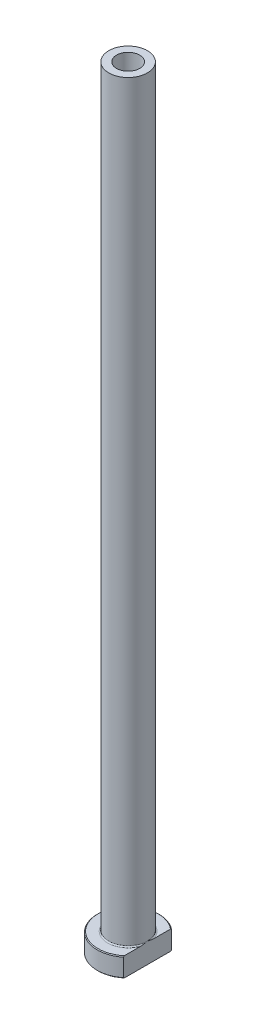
from build123d import *

# Parameters (mm, degrees)
FILLET1_R          = 0.3
CHAMFER1_SIZE      = 0.2
CUT_EXTRUDE1_DEPTH = 201.319744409
CHAMFER2_SIZE      = 0.5


with BuildPart() as part:
    # Sketch1 → Revolve1 (revolve)
    with BuildSketch(Plane.XY, mode=Mode.PRIVATE) as revolve1_sk:
        Polygon((-3, 200), (-5, 200), (-5, 5), (-8, 5), (-8, 0), (-3.25, 0), (-3.25, 143), (-3, 155), align=None)
    revolve(revolve1_sk.sketch.rotate(Axis((0, 92.187680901, 0), (0, -1, 0)), 270), axis=Axis((0, 92.187680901, 0), (0, -1, 0)))

    # Fillet1
    fillet1_edges = [part.edges().sort_by_distance(p)[0] for p in [
        (0, 5, -5),
    ]]
    fillet(fillet1_edges, radius=FILLET1_R)

    # Chamfer1
    chamfer1_edges = [part.edges().sort_by_distance(p)[0] for p in [
        (0, 0, -8),
        (0, 5, -8),
    ]]
    chamfer(chamfer1_edges, length=CHAMFER1_SIZE)

    # Sketch2 → Cut-Extrude1 (cut, through all)
    with BuildSketch(Plane.XZ):
        with BuildLine():
            Line((5, 6.244997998), (5, -6.244997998))
            ThreePointArc((5, -6.244997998), (8, 0), (5, 6.244997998))
        make_face()
    extrude(amount=-CUT_EXTRUDE1_DEPTH, mode=Mode.SUBTRACT)

    # Chamfer2
    chamfer2_edges = [part.edges().sort_by_distance(p)[0] for p in [
        (0, 0, -3.25),
    ]]
    chamfer(chamfer2_edges, length=CHAMFER2_SIZE)


solid = part.part
